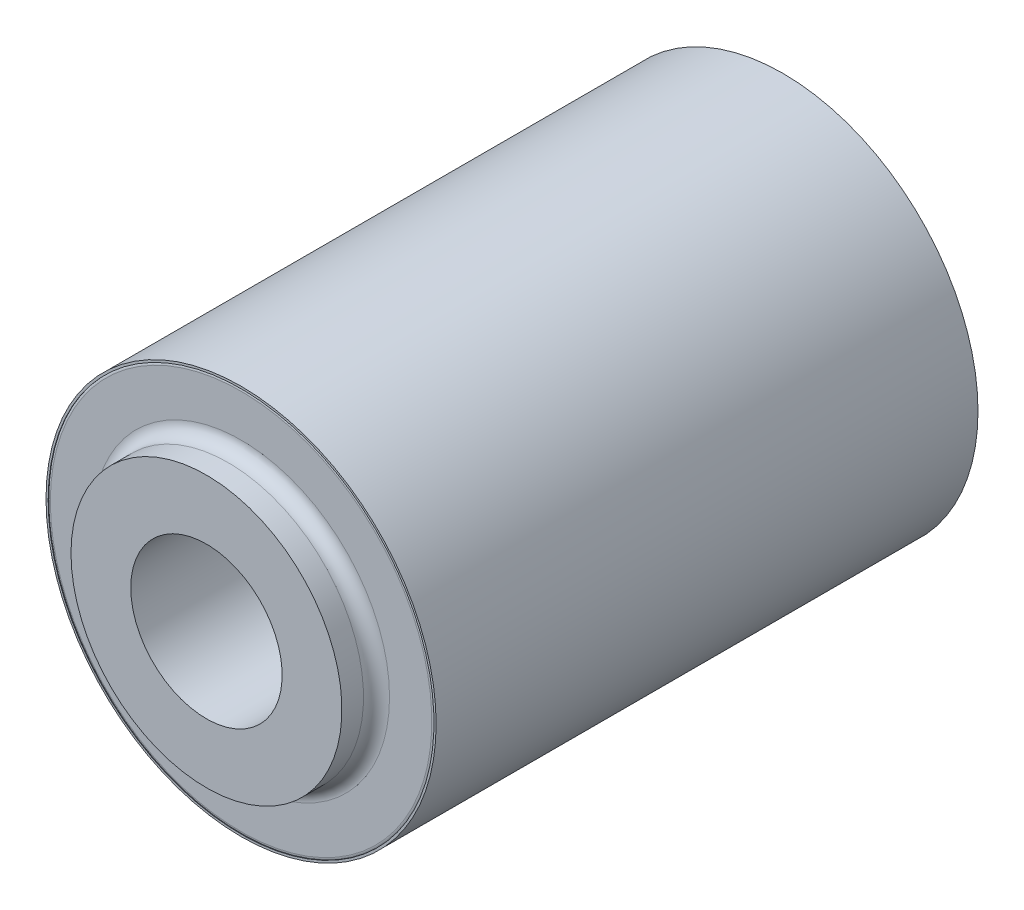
ISO-10303-21;
HEADER;
FILE_DESCRIPTION(('STEP AP214'),'2;1');
FILE_NAME('part.step','',(''),(''),'','','');
FILE_SCHEMA(('AUTOMOTIVE_DESIGN { 1 0 10303 214 1 1 1 1 }'));
ENDSEC;
DATA;
#1=APPLICATION_CONTEXT('core data for automotive mechanical design processes');
#2=APPLICATION_PROTOCOL_DEFINITION('international standard','automotive_design',2000,#1);
#3=PRODUCT_CONTEXT('',#1,'mechanical');
#4=PRODUCT('Part','Part','',(#3));
#5=PRODUCT_RELATED_PRODUCT_CATEGORY('part','',(#4));
#6=PRODUCT_DEFINITION_FORMATION('','',#4);
#7=PRODUCT_DEFINITION_CONTEXT('part definition',#1,'design');
#8=PRODUCT_DEFINITION('design','',#6,#7);
#9=PRODUCT_DEFINITION_SHAPE('','',#8);
#10=(LENGTH_UNIT() NAMED_UNIT(*) SI_UNIT(.MILLI.,.METRE.));
#11=(NAMED_UNIT(*) PLANE_ANGLE_UNIT() SI_UNIT($,.RADIAN.));
#12=(NAMED_UNIT(*) SI_UNIT($,.STERADIAN.) SOLID_ANGLE_UNIT());
#13=UNCERTAINTY_MEASURE_WITH_UNIT(LENGTH_MEASURE(1.E-05),#10,'distance_accuracy_value','');
#14=(GEOMETRIC_REPRESENTATION_CONTEXT(3) GLOBAL_UNCERTAINTY_ASSIGNED_CONTEXT((#13)) GLOBAL_UNIT_ASSIGNED_CONTEXT((#10,
#11,#12)) REPRESENTATION_CONTEXT('',''));
#15=CARTESIAN_POINT('',(0.,0.,0.));
#16=DIRECTION('',(0.,0.,1.));
#17=DIRECTION('',(1.,0.,0.));
#18=AXIS2_PLACEMENT_3D('',#15,#16,#17);
#19=CARTESIAN_POINT('',(0.,0.,-22.8954072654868));
#20=DIRECTION('',(0.,0.,-1.));
#21=DIRECTION('',(-1.,0.,0.));
#22=AXIS2_PLACEMENT_3D('',#19,#20,#21);
#23=CYLINDRICAL_SURFACE('',#22,4.43535707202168);
#24=CARTESIAN_POINT('',(0.,0.,-17.9037411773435));
#25=DIRECTION('',(0.,0.,-1.));
#26=DIRECTION('',(-1.,0.,0.));
#27=AXIS2_PLACEMENT_3D('',#24,#25,#26);
#28=CIRCLE('',#27,4.43535707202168);
#29=CARTESIAN_POINT('',(-4.43535707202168,0.,-17.9037411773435));
#30=VERTEX_POINT('',#29);
#31=EDGE_CURVE('E46',#30,#30,#28,.F.);
#32=ORIENTED_EDGE('',*,*,#31,.F.);
#33=EDGE_LOOP('',(#32));
#34=FACE_BOUND('',#33,.T.);
#35=CARTESIAN_POINT('',(0.,0.,17.9037411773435));
#36=DIRECTION('',(0.,0.,-1.));
#37=DIRECTION('',(-1.,0.,0.));
#38=AXIS2_PLACEMENT_3D('',#35,#36,#37);
#39=CIRCLE('',#38,4.43535707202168);
#40=CARTESIAN_POINT('',(-4.43535707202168,0.,17.9037411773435));
#41=VERTEX_POINT('',#40);
#42=EDGE_CURVE('E17',#41,#41,#39,.T.);
#43=ORIENTED_EDGE('',*,*,#42,.F.);
#44=EDGE_LOOP('',(#43));
#45=FACE_BOUND('',#44,.T.);
#46=ADVANCED_FACE('F14',(#34,#45),#23,.F.);
#47=CARTESIAN_POINT('',(0.,7.9375,17.9037411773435));
#48=DIRECTION('',(0.,0.,1.));
#49=DIRECTION('',(1.,0.,0.));
#50=AXIS2_PLACEMENT_3D('',#47,#48,#49);
#51=PLANE('',#50);
#52=ORIENTED_EDGE('',*,*,#42,.T.);
#53=EDGE_LOOP('',(#52));
#54=FACE_BOUND('',#53,.T.);
#55=CARTESIAN_POINT('',(0.,0.,17.9037411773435));
#56=DIRECTION('',(0.,0.,-1.));
#57=DIRECTION('',(-1.,0.,0.));
#58=AXIS2_PLACEMENT_3D('',#55,#56,#57);
#59=CIRCLE('',#58,7.9375);
#60=CARTESIAN_POINT('',(-7.9375,0.,17.9037411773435));
#61=VERTEX_POINT('',#60);
#62=EDGE_CURVE('E44',#61,#61,#59,.T.);
#63=ORIENTED_EDGE('',*,*,#62,.F.);
#64=EDGE_LOOP('',(#63));
#65=FACE_BOUND('',#64,.T.);
#66=ADVANCED_FACE('F53',(#54,#65),#51,.T.);
#67=CARTESIAN_POINT('',(0.,7.9375,-17.9037411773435));
#68=DIRECTION('',(0.,0.,-1.));
#69=DIRECTION('',(-1.,0.,0.));
#70=AXIS2_PLACEMENT_3D('',#67,#68,#69);
#71=PLANE('',#70);
#72=ORIENTED_EDGE('',*,*,#31,.T.);
#73=EDGE_LOOP('',(#72));
#74=FACE_BOUND('',#73,.T.);
#75=CARTESIAN_POINT('',(0.,0.,-17.9037411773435));
#76=DIRECTION('',(0.,0.,-1.));
#77=DIRECTION('',(-1.,0.,0.));
#78=AXIS2_PLACEMENT_3D('',#75,#76,#77);
#79=CIRCLE('',#78,7.9375);
#80=CARTESIAN_POINT('',(-7.9375,0.,-17.9037411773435));
#81=VERTEX_POINT('',#80);
#82=EDGE_CURVE('E40',#81,#81,#79,.F.);
#83=ORIENTED_EDGE('',*,*,#82,.F.);
#84=EDGE_LOOP('',(#83));
#85=FACE_BOUND('',#84,.T.);
#86=ADVANCED_FACE('F62',(#74,#85),#71,.T.);
#87=CARTESIAN_POINT('',(0.,0.,-22.8954072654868));
#88=DIRECTION('',(0.,0.,-1.));
#89=DIRECTION('',(-1.,0.,0.));
#90=AXIS2_PLACEMENT_3D('',#87,#88,#89);
#91=CYLINDRICAL_SURFACE('',#90,7.9375);
#92=CARTESIAN_POINT('',(0.,0.,16.637));
#93=DIRECTION('',(0.,0.,-1.));
#94=DIRECTION('',(-1.,0.,0.));
#95=AXIS2_PLACEMENT_3D('',#92,#93,#94);
#96=CIRCLE('',#95,7.9375);
#97=CARTESIAN_POINT('',(-7.9375,0.,16.637));
#98=VERTEX_POINT('',#97);
#99=EDGE_CURVE('E43',#98,#98,#96,.F.);
#100=ORIENTED_EDGE('',*,*,#99,.T.);
#101=EDGE_LOOP('',(#100));
#102=FACE_BOUND('',#101,.T.);
#103=ORIENTED_EDGE('',*,*,#62,.T.);
#104=EDGE_LOOP('',(#103));
#105=FACE_BOUND('',#104,.T.);
#106=ADVANCED_FACE('F214',(#102,#105),#91,.T.);
#107=CARTESIAN_POINT('',(0.,0.,-22.8954072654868));
#108=DIRECTION('',(0.,0.,-1.));
#109=DIRECTION('',(-1.,0.,0.));
#110=AXIS2_PLACEMENT_3D('',#107,#108,#109);
#111=CYLINDRICAL_SURFACE('',#110,7.9375);
#112=ORIENTED_EDGE('',*,*,#82,.T.);
#113=EDGE_LOOP('',(#112));
#114=FACE_BOUND('',#113,.T.);
#115=CARTESIAN_POINT('',(0.,0.,-16.637));
#116=DIRECTION('',(0.,0.,-1.));
#117=DIRECTION('',(-1.,0.,0.));
#118=AXIS2_PLACEMENT_3D('',#115,#116,#117);
#119=CIRCLE('',#118,7.9375);
#120=CARTESIAN_POINT('',(-7.9375,0.,-16.637));
#121=VERTEX_POINT('',#120);
#122=EDGE_CURVE('E181',#121,#121,#119,.T.);
#123=ORIENTED_EDGE('',*,*,#122,.T.);
#124=EDGE_LOOP('',(#123));
#125=FACE_BOUND('',#124,.T.);
#126=ADVANCED_FACE('F211',(#114,#125),#111,.T.);
#127=CARTESIAN_POINT('',(0.,0.,16.637));
#128=DIRECTION('',(0.,0.,-1.));
#129=DIRECTION('',(-1.,0.,0.));
#130=AXIS2_PLACEMENT_3D('',#127,#128,#129);
#131=TOROIDAL_SURFACE('',#130,8.6995,0.762);
#132=ORIENTED_EDGE('',*,*,#99,.F.);
#133=EDGE_LOOP('',(#132));
#134=FACE_BOUND('',#133,.T.);
#135=CARTESIAN_POINT('',(0.,0.,15.875));
#136=DIRECTION('',(0.,0.,1.));
#137=DIRECTION('',(-1.,0.,0.));
#138=AXIS2_PLACEMENT_3D('',#135,#136,#137);
#139=CIRCLE('',#138,8.6995);
#140=CARTESIAN_POINT('',(-8.6995,0.,15.875));
#141=VERTEX_POINT('',#140);
#142=EDGE_CURVE('E160',#141,#141,#139,.F.);
#143=ORIENTED_EDGE('',*,*,#142,.F.);
#144=EDGE_LOOP('',(#143));
#145=FACE_BOUND('',#144,.T.);
#146=ADVANCED_FACE('F186',(#134,#145),#131,.F.);
#147=CARTESIAN_POINT('',(0.,0.,-16.637));
#148=DIRECTION('',(0.,0.,-1.));
#149=DIRECTION('',(-1.,0.,0.));
#150=AXIS2_PLACEMENT_3D('',#147,#148,#149);
#151=TOROIDAL_SURFACE('',#150,8.6995,0.762);
#152=CARTESIAN_POINT('',(0.,0.,-15.875));
#153=DIRECTION('',(0.,0.,-1.));
#154=DIRECTION('',(-1.,0.,0.));
#155=AXIS2_PLACEMENT_3D('',#152,#153,#154);
#156=CIRCLE('',#155,8.6995);
#157=CARTESIAN_POINT('',(-8.6995,0.,-15.875));
#158=VERTEX_POINT('',#157);
#159=EDGE_CURVE('E207',#158,#158,#156,.F.);
#160=ORIENTED_EDGE('',*,*,#159,.F.);
#161=EDGE_LOOP('',(#160));
#162=FACE_BOUND('',#161,.T.);
#163=ORIENTED_EDGE('',*,*,#122,.F.);
#164=EDGE_LOOP('',(#163));
#165=FACE_BOUND('',#164,.T.);
#166=ADVANCED_FACE('F183',(#162,#165),#151,.F.);
#167=CARTESIAN_POINT('',(0.,8.6995,15.875));
#168=DIRECTION('',(0.,0.,1.));
#169=DIRECTION('',(1.,0.,0.));
#170=AXIS2_PLACEMENT_3D('',#167,#168,#169);
#171=PLANE('',#170);
#172=ORIENTED_EDGE('',*,*,#142,.T.);
#173=EDGE_LOOP('',(#172));
#174=FACE_BOUND('',#173,.T.);
#175=CARTESIAN_POINT('',(0.,0.,15.875));
#176=DIRECTION('',(0.,0.,-1.));
#177=DIRECTION('',(-1.,0.,0.));
#178=AXIS2_PLACEMENT_3D('',#175,#176,#177);
#179=CIRCLE('',#178,11.176);
#180=CARTESIAN_POINT('',(-11.176,0.,15.875));
#181=VERTEX_POINT('',#180);
#182=EDGE_CURVE('E147',#181,#181,#179,.T.);
#183=ORIENTED_EDGE('',*,*,#182,.F.);
#184=EDGE_LOOP('',(#183));
#185=FACE_BOUND('',#184,.T.);
#186=ADVANCED_FACE('F122',(#174,#185),#171,.T.);
#187=CARTESIAN_POINT('',(0.,8.6995,-15.875));
#188=DIRECTION('',(0.,0.,-1.));
#189=DIRECTION('',(-1.,0.,0.));
#190=AXIS2_PLACEMENT_3D('',#187,#188,#189);
#191=PLANE('',#190);
#192=ORIENTED_EDGE('',*,*,#159,.T.);
#193=EDGE_LOOP('',(#192));
#194=FACE_BOUND('',#193,.T.);
#195=CARTESIAN_POINT('',(0.,0.,-15.875));
#196=DIRECTION('',(0.,0.,1.));
#197=DIRECTION('',(-1.,0.,0.));
#198=AXIS2_PLACEMENT_3D('',#195,#196,#197);
#199=CIRCLE('',#198,11.176);
#200=CARTESIAN_POINT('',(-11.176,0.,-15.875));
#201=VERTEX_POINT('',#200);
#202=EDGE_CURVE('E107',#201,#201,#199,.T.);
#203=ORIENTED_EDGE('',*,*,#202,.F.);
#204=EDGE_LOOP('',(#203));
#205=FACE_BOUND('',#204,.T.);
#206=ADVANCED_FACE('F113',(#194,#205),#191,.T.);
#207=CARTESIAN_POINT('',(0.,0.,15.621));
#208=DIRECTION('',(0.,0.,-1.));
#209=DIRECTION('',(-1.,0.,0.));
#210=AXIS2_PLACEMENT_3D('',#207,#208,#209);
#211=TOROIDAL_SURFACE('',#210,11.176,0.254);
#212=CARTESIAN_POINT('',(0.,0.,15.8409704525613));
#213=DIRECTION('',(0.,0.,-1.));
#214=DIRECTION('',(-1.,0.,0.));
#215=AXIS2_PLACEMENT_3D('',#212,#213,#214);
#216=CIRCLE('',#215,11.303);
#217=CARTESIAN_POINT('',(-11.303,0.,15.8409704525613));
#218=VERTEX_POINT('',#217);
#219=EDGE_CURVE('E291',#218,#218,#216,.F.);
#220=ORIENTED_EDGE('',*,*,#219,.T.);
#221=EDGE_LOOP('',(#220));
#222=FACE_BOUND('',#221,.T.);
#223=ORIENTED_EDGE('',*,*,#182,.T.);
#224=EDGE_LOOP('',(#223));
#225=FACE_BOUND('',#224,.T.);
#226=ADVANCED_FACE('F91',(#222,#225),#211,.T.);
#227=CARTESIAN_POINT('',(0.,0.,-15.621));
#228=DIRECTION('',(0.,0.,-1.));
#229=DIRECTION('',(-1.,0.,0.));
#230=AXIS2_PLACEMENT_3D('',#227,#228,#229);
#231=TOROIDAL_SURFACE('',#230,11.176,0.254);
#232=ORIENTED_EDGE('',*,*,#202,.T.);
#233=EDGE_LOOP('',(#232));
#234=FACE_BOUND('',#233,.T.);
#235=CARTESIAN_POINT('',(0.,0.,-15.8409704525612));
#236=DIRECTION('',(0.,0.,-1.));
#237=DIRECTION('',(-1.,0.,0.));
#238=AXIS2_PLACEMENT_3D('',#235,#236,#237);
#239=CIRCLE('',#238,11.303);
#240=CARTESIAN_POINT('',(-11.303,0.,-15.8409704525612));
#241=VERTEX_POINT('',#240);
#242=EDGE_CURVE('E39',#241,#241,#239,.T.);
#243=ORIENTED_EDGE('',*,*,#242,.T.);
#244=EDGE_LOOP('',(#243));
#245=FACE_BOUND('',#244,.T.);
#246=ADVANCED_FACE('F85',(#234,#245),#231,.T.);
#247=CARTESIAN_POINT('',(0.,0.,15.875));
#248=DIRECTION('',(0.,0.,-1.));
#249=DIRECTION('',(-1.,0.,0.));
#250=AXIS2_PLACEMENT_3D('',#247,#248,#249);
#251=CYLINDRICAL_SURFACE('',#250,11.303);
#252=ORIENTED_EDGE('',*,*,#219,.F.);
#253=EDGE_LOOP('',(#252));
#254=FACE_BOUND('',#253,.T.);
#255=CARTESIAN_POINT('',(0.,0.,15.875));
#256=DIRECTION('',(0.,0.,-1.));
#257=DIRECTION('',(-1.,0.,0.));
#258=AXIS2_PLACEMENT_3D('',#255,#256,#257);
#259=CIRCLE('',#258,11.303);
#260=CARTESIAN_POINT('',(-11.303,0.,15.875));
#261=VERTEX_POINT('',#260);
#262=EDGE_CURVE('E36',#261,#261,#259,.T.);
#263=ORIENTED_EDGE('',*,*,#262,.F.);
#264=EDGE_LOOP('',(#263));
#265=FACE_BOUND('',#264,.T.);
#266=ADVANCED_FACE('F81',(#254,#265),#251,.F.);
#267=CARTESIAN_POINT('',(0.,0.,15.875));
#268=DIRECTION('',(0.,0.,-1.));
#269=DIRECTION('',(-1.,0.,0.));
#270=AXIS2_PLACEMENT_3D('',#267,#268,#269);
#271=CYLINDRICAL_SURFACE('',#270,11.303);
#272=CARTESIAN_POINT('',(0.,0.,-15.875));
#273=DIRECTION('',(0.,0.,-1.));
#274=DIRECTION('',(-1.,0.,0.));
#275=AXIS2_PLACEMENT_3D('',#272,#273,#274);
#276=CIRCLE('',#275,11.303);
#277=CARTESIAN_POINT('',(-11.303,0.,-15.875));
#278=VERTEX_POINT('',#277);
#279=EDGE_CURVE('E26',#278,#278,#276,.T.);
#280=ORIENTED_EDGE('',*,*,#279,.T.);
#281=EDGE_LOOP('',(#280));
#282=FACE_BOUND('',#281,.T.);
#283=ORIENTED_EDGE('',*,*,#242,.F.);
#284=EDGE_LOOP('',(#283));
#285=FACE_BOUND('',#284,.T.);
#286=ADVANCED_FACE('F77',(#282,#285),#271,.F.);
#287=CARTESIAN_POINT('',(0.,0.,15.875));
#288=DIRECTION('',(0.,0.,1.));
#289=DIRECTION('',(1.,0.,0.));
#290=AXIS2_PLACEMENT_3D('',#287,#288,#289);
#291=PLANE('',#290);
#292=ORIENTED_EDGE('',*,*,#262,.T.);
#293=EDGE_LOOP('',(#292));
#294=FACE_BOUND('',#293,.T.);
#295=CARTESIAN_POINT('',(0.,0.,15.875));
#296=DIRECTION('',(0.,0.,-1.));
#297=DIRECTION('',(-1.,0.,0.));
#298=AXIS2_PLACEMENT_3D('',#295,#296,#297);
#299=CIRCLE('',#298,11.43);
#300=CARTESIAN_POINT('',(-11.43,0.,15.875));
#301=VERTEX_POINT('',#300);
#302=EDGE_CURVE('E21',#301,#301,#299,.T.);
#303=ORIENTED_EDGE('',*,*,#302,.F.);
#304=EDGE_LOOP('',(#303));
#305=FACE_BOUND('',#304,.T.);
#306=ADVANCED_FACE('F70',(#294,#305),#291,.T.);
#307=CARTESIAN_POINT('',(0.,0.,-15.875));
#308=DIRECTION('',(0.,0.,1.));
#309=DIRECTION('',(1.,0.,0.));
#310=AXIS2_PLACEMENT_3D('',#307,#308,#309);
#311=PLANE('',#310);
#312=ORIENTED_EDGE('',*,*,#279,.F.);
#313=EDGE_LOOP('',(#312));
#314=FACE_BOUND('',#313,.T.);
#315=CARTESIAN_POINT('',(0.,0.,-15.875));
#316=DIRECTION('',(0.,0.,-1.));
#317=DIRECTION('',(-1.,0.,0.));
#318=AXIS2_PLACEMENT_3D('',#315,#316,#317);
#319=CIRCLE('',#318,11.43);
#320=CARTESIAN_POINT('',(-11.43,0.,-15.875));
#321=VERTEX_POINT('',#320);
#322=EDGE_CURVE('E10',#321,#321,#319,.F.);
#323=ORIENTED_EDGE('',*,*,#322,.F.);
#324=EDGE_LOOP('',(#323));
#325=FACE_BOUND('',#324,.T.);
#326=ADVANCED_FACE('F65',(#314,#325),#311,.F.);
#327=CARTESIAN_POINT('',(0.,0.,15.875));
#328=DIRECTION('',(0.,0.,-1.));
#329=DIRECTION('',(-1.,0.,0.));
#330=AXIS2_PLACEMENT_3D('',#327,#328,#329);
#331=CYLINDRICAL_SURFACE('',#330,11.43);
#332=ORIENTED_EDGE('',*,*,#322,.T.);
#333=EDGE_LOOP('',(#332));
#334=FACE_BOUND('',#333,.T.);
#335=ORIENTED_EDGE('',*,*,#302,.T.);
#336=EDGE_LOOP('',(#335));
#337=FACE_BOUND('',#336,.T.);
#338=ADVANCED_FACE('F63',(#334,#337),#331,.T.);
#339=CLOSED_SHELL('',(#46,#66,#86,#106,#126,#146,#166,#186,#206,#226,#246,#266,#286,#306,#326,#338));
#340=MANIFOLD_SOLID_BREP('B1',#339);
#341=ADVANCED_BREP_SHAPE_REPRESENTATION('',(#18,#340),#14);
#342=SHAPE_DEFINITION_REPRESENTATION(#9,#341);
ENDSEC;
END-ISO-10303-21;
